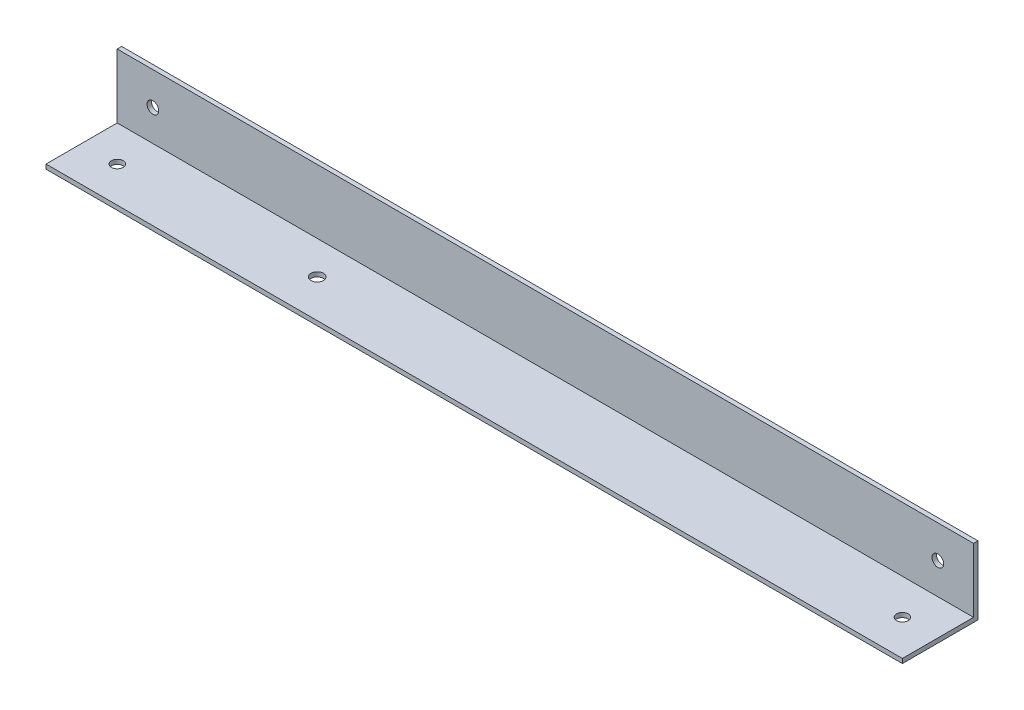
from build123d import *

# Parameters (mm, degrees)
SKETCH1_W           = 304.8
SKETCH1_H           = 24.384
BOSS_EXTRUDE1_DEPTH = 26.924
SKETCH2_W           = 304.8
SKETCH2_H           = 25.3365
CUT_EXTRUDE1_DEPTH  = 12.7
SKETCH3_W           = 304.8
SKETCH3_H           = 10.0965
CUT_EXTRUDE3_DEPTH  = 25.3365
SKETCH4_R           = 2.0828
CUT_EXTRUDE4_DEPTH  = 2.54
SKETCH5_R           = 2.0828
CUT_EXTRUDE5_DEPTH  = 2.54
SKETCH7_R           = 2.2349968
CUT_EXTRUDE6_DEPTH  = 2.54


with BuildPart() as part:
    # Sketch1 → Boss-Extrude1 (new body)
    with BuildSketch(Plane.XY):
        with Locations((-57.426086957, 55.646509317)):
            Rectangle(SKETCH1_W, SKETCH1_H)
    extrude(amount=BOSS_EXTRUDE1_DEPTH)

    # Sketch2 → Cut-Extrude1 (cut)
    with BuildSketch(Plane(origin=(0, 67.838509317, 0), x_dir=(1, 0, 0), z_dir=(0, 1, 0))):
        with Locations((-57.426086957, -14.25575)):
            Rectangle(SKETCH2_W, SKETCH2_H)
    extrude(amount=-CUT_EXTRUDE1_DEPTH, mode=Mode.SUBTRACT)

    # Sketch3 → Cut-Extrude3 (cut)
    with BuildSketch(Plane.XY.offset(26.924)):
        with Locations((-57.426086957, 50.090259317)):
            Rectangle(SKETCH3_W, SKETCH3_H)
    extrude(amount=-CUT_EXTRUDE3_DEPTH, mode=Mode.SUBTRACT)

    # Sketch4 → Cut-Extrude4 (cut)
    with BuildSketch(Plane(origin=(0, 0, 0), x_dir=(-1, 0, 0), z_dir=(0, 0, -1))):
        with Locations((-82.273913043, 56.154509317)):
            Circle(SKETCH4_R)
        with Locations((197.126086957, 56.154509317)):
            Circle(SKETCH4_R)
    extrude(amount=-CUT_EXTRUDE4_DEPTH, mode=Mode.SUBTRACT)

    # Sketch5 → Cut-Extrude5 (cut)
    with BuildSketch(Plane.XZ.offset(-43.454509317)):
        with Locations(Location((-197.126086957, 14.224, 0), (0, 0, 270))):
            Circle(SKETCH5_R)
        with Locations(Location((82.273913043, 14.224, 0), (0, 0, 270))):
            Circle(SKETCH5_R)
    extrude(amount=-CUT_EXTRUDE5_DEPTH, mode=Mode.SUBTRACT)

    # Sketch7 → Cut-Extrude6 (cut)
    with BuildSketch(Plane.XZ.offset(-43.454509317)):
        with Locations(Location((-126.768086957, 13.462, 0), (0, 0, 270))):
            Circle(SKETCH7_R)
    extrude(amount=-CUT_EXTRUDE6_DEPTH, mode=Mode.SUBTRACT)


solid = part.part
